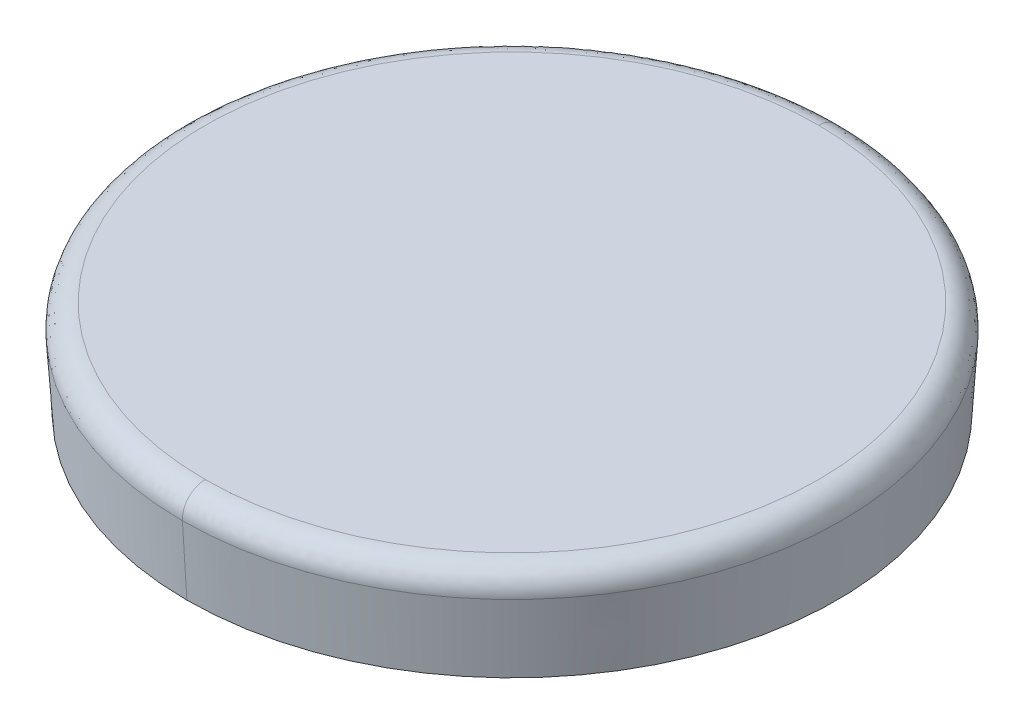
ISO-10303-21;
HEADER;
FILE_DESCRIPTION(('STEP AP214'),'2;1');
FILE_NAME('part.step','',(''),(''),'','','');
FILE_SCHEMA(('AUTOMOTIVE_DESIGN { 1 0 10303 214 1 1 1 1 }'));
ENDSEC;
DATA;
#1=APPLICATION_CONTEXT('core data for automotive mechanical design processes');
#2=APPLICATION_PROTOCOL_DEFINITION('international standard','automotive_design',2000,#1);
#3=PRODUCT_CONTEXT('',#1,'mechanical');
#4=PRODUCT('Part','Part','',(#3));
#5=PRODUCT_RELATED_PRODUCT_CATEGORY('part','',(#4));
#6=PRODUCT_DEFINITION_FORMATION('','',#4);
#7=PRODUCT_DEFINITION_CONTEXT('part definition',#1,'design');
#8=PRODUCT_DEFINITION('design','',#6,#7);
#9=PRODUCT_DEFINITION_SHAPE('','',#8);
#10=(LENGTH_UNIT() NAMED_UNIT(*) SI_UNIT(.MILLI.,.METRE.));
#11=(NAMED_UNIT(*) PLANE_ANGLE_UNIT() SI_UNIT($,.RADIAN.));
#12=(NAMED_UNIT(*) SI_UNIT($,.STERADIAN.) SOLID_ANGLE_UNIT());
#13=UNCERTAINTY_MEASURE_WITH_UNIT(LENGTH_MEASURE(1.E-05),#10,'distance_accuracy_value','');
#14=(GEOMETRIC_REPRESENTATION_CONTEXT(3) GLOBAL_UNCERTAINTY_ASSIGNED_CONTEXT((#13)) GLOBAL_UNIT_ASSIGNED_CONTEXT((#10,
#11,#12)) REPRESENTATION_CONTEXT('',''));
#15=CARTESIAN_POINT('',(0.,0.,0.));
#16=DIRECTION('',(0.,0.,1.));
#17=DIRECTION('',(1.,0.,0.));
#18=AXIS2_PLACEMENT_3D('',#15,#16,#17);
#19=CARTESIAN_POINT('',(21.4,13.2498606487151,-8.7841428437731));
#20=CARTESIAN_POINT('',(29.4317143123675,13.2498606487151,-8.7841428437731));
#21=CARTESIAN_POINT('',(29.4317143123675,13.2498606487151,-16.8158571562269));
#22=CARTESIAN_POINT('',(21.4,13.2498606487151,-16.8158571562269));
#23=CARTESIAN_POINT('',(21.4,13.255742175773,-8.59124459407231));
#24=CARTESIAN_POINT('',(29.8175108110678,13.255742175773,-8.59124459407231));
#25=CARTESIAN_POINT('',(29.8175108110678,13.255742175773,-17.0087554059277));
#26=CARTESIAN_POINT('',(21.4,13.255742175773,-17.0087554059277));
#27=CARTESIAN_POINT('',(21.4,13.1152805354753,-8.45882287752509));
#28=CARTESIAN_POINT('',(30.0823542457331,13.1152805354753,-8.4588228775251));
#29=CARTESIAN_POINT('',(30.0823542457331,13.1152805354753,-17.1411771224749));
#30=CARTESIAN_POINT('',(21.4,13.1152805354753,-17.1411771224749));
#31=CARTESIAN_POINT('',(21.4,12.9229709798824,-8.47622009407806));
#32=CARTESIAN_POINT('',(30.0475598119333,12.9229709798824,-8.47622009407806));
#33=CARTESIAN_POINT('',(30.0475598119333,12.9229709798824,-17.1237799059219));
#34=CARTESIAN_POINT('',(21.4,12.9229709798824,-17.1237799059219));
#35=(BOUNDED_SURFACE() B_SPLINE_SURFACE(3,3,((#19,#20,#21,#22),(#23,#24,#25,#26),(#27,#28,#29,
#30),(#31,#32,#33,#34)),.UNSPECIFIED.,.F.,.F.,.F.) B_SPLINE_SURFACE_WITH_KNOTS((4,4),(4,4),
(0.0430785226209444,0.955176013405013),(0.,1.),
.UNSPECIFIED.) GEOMETRIC_REPRESENTATION_ITEM() RATIONAL_B_SPLINE_SURFACE(((0.96771784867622,
0.322572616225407,0.322572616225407,0.96771784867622),(0.750138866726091,0.250046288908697,
0.250046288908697,0.750138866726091),(0.749723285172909,0.249907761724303,0.249907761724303,
0.749723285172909),(0.966471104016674,0.322157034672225,0.322157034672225,0.966471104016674))) REPRESENTATION_ITEM('') SURFACE());
#36=CARTESIAN_POINT('',(21.4,12.931231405,-12.8));
#37=DIRECTION('',(0.,1.,0.));
#38=DIRECTION('',(0.,0.,1.));
#39=AXIS2_PLACEMENT_3D('',#36,#37,#38);
#40=CIRCLE('',#39,4.32441232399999);
#41=CARTESIAN_POINT('',(21.4,12.9312314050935,-8.47558767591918));
#42=VERTEX_POINT('',#41);
#43=CARTESIAN_POINT('',(21.3999999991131,12.9312314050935,-17.1244123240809));
#44=VERTEX_POINT('',#43);
#45=EDGE_CURVE('E84',#42,#44,#40,.T.);
#46=CARTESIAN_POINT('',(21.3999999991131,12.9312314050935,-17.1244123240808));
#47=CARTESIAN_POINT('',(21.4,13.1154565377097,-17.1359604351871));
#48=CARTESIAN_POINT('',(21.4,13.2500000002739,-17.0095867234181));
#49=CARTESIAN_POINT('',(21.4,13.250000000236,-16.8249999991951));
#50=(BOUNDED_CURVE() B_SPLINE_CURVE(3,(#46,#47,#48,#49),.UNSPECIFIED.,.F.,
.F.) B_SPLINE_CURVE_WITH_KNOTS((4,4),(0.0615373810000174,0.938462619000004),
.UNSPECIFIED.) CURVE() GEOMETRIC_REPRESENTATION_ITEM() RATIONAL_B_SPLINE_CURVE((0.954774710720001,
0.754036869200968,0.754036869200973,0.954774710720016)) REPRESENTATION_ITEM(''));
#51=CARTESIAN_POINT('',(21.4,13.250000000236,-16.8249999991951));
#52=VERTEX_POINT('',#51);
#53=EDGE_CURVE('E53',#44,#52,#50,.T.);
#54=CARTESIAN_POINT('',(21.4,13.250000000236,-8.77500000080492));
#55=CARTESIAN_POINT('',(21.5915795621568,13.25,-8.77500000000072));
#56=CARTESIAN_POINT('',(21.8761392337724,13.25,-8.79512500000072));
#57=CARTESIAN_POINT('',(22.2032085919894,13.25,-8.85382291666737));
#58=CARTESIAN_POINT('',(22.3655140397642,13.25,-8.8919765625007));
#59=CARTESIAN_POINT('',(22.4463594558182,13.25,-8.91325455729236));
#60=CARTESIAN_POINT('',(22.4867053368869,13.25,-8.92444384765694));
#61=CARTESIAN_POINT('',(22.5039799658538,13.25,-8.92935717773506));
#62=CARTESIAN_POINT('',(22.5154927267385,13.25,-8.93265893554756));
#63=CARTESIAN_POINT('',(22.5201588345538,13.25,-8.93400560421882));
#64=CARTESIAN_POINT('',(22.6364586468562,13.25,-8.96791033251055));
#65=CARTESIAN_POINT('',(22.7981481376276,13.25,-9.0225958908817));
#66=CARTESIAN_POINT('',(22.9824135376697,13.25,-9.09833081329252));
#67=CARTESIAN_POINT('',(23.073453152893,13.25,-9.13918205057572));
#68=CARTESIAN_POINT('',(23.1122358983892,13.25,-9.15732910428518));
#69=CARTESIAN_POINT('',(23.1380390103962,13.25,-9.16956922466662));
#70=CARTESIAN_POINT('',(23.1494252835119,13.25,-9.17503454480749));
#71=CARTESIAN_POINT('',(23.2784741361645,13.25,-9.23792588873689));
#72=CARTESIAN_POINT('',(23.4459111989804,13.25,-9.32960064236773));
#73=CARTESIAN_POINT('',(23.6331553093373,13.25,-9.45023887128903));
#74=CARTESIAN_POINT('',(23.7247525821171,13.25,-9.51397907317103));
#75=CARTESIAN_POINT('',(23.7635746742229,13.25,-9.54202939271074));
#76=CARTESIAN_POINT('',(23.7893596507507,13.25,-9.56089251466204));
#77=CARTESIAN_POINT('',(23.8008932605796,13.25,-9.56942279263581));
#78=CARTESIAN_POINT('',(23.9278539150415,13.25,-9.66461765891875));
#79=CARTESIAN_POINT('',(24.0896861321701,13.25,-9.79975898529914));
#80=CARTESIAN_POINT('',(24.2654552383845,13.25,-9.97179983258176));
#81=CARTESIAN_POINT('',(24.350081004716,13.25,-10.0614142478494));
#82=CARTESIAN_POINT('',(24.3856508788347,13.25,-10.1005905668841));
#83=CARTESIAN_POINT('',(24.4092089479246,13.25,-10.1268792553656));
#84=CARTESIAN_POINT('',(24.4199439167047,13.25,-10.1390020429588));
#85=CARTESIAN_POINT('',(24.5332568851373,13.25,-10.2688055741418));
#86=CARTESIAN_POINT('',(24.6736659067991,13.25,-10.4493984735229));
#87=CARTESIAN_POINT('',(24.818795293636,13.25,-10.6732528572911));
#88=CARTESIAN_POINT('',(24.8769905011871,13.25,-10.772011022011));
#89=CARTESIAN_POINT('',(24.9148977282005,13.25,-10.8384765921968));
#90=CARTESIAN_POINT('',(24.9323542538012,13.25,-10.870050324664));
#91=CARTESIAN_POINT('',(25.0279359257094,13.25,-11.0492104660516));
#92=CARTESIAN_POINT('',(25.1289953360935,13.25,-11.2696251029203));
#93=CARTESIAN_POINT('',(25.2230304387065,13.25,-11.5362648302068));
#94=CARTESIAN_POINT('',(25.2582167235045,13.25,-11.6525724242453));
#95=CARTESIAN_POINT('',(25.2805376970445,13.25,-11.7305626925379));
#96=CARTESIAN_POINT('',(25.2908390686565,13.25,-11.7686392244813));
#97=CARTESIAN_POINT('',(25.3836720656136,13.25,-12.133963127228));
#98=CARTESIAN_POINT('',(25.4249542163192,13.25,-12.4649471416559));
#99=CARTESIAN_POINT('',(25.4250228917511,13.25,-12.967526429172));
#100=CARTESIAN_POINT('',(25.4095592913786,13.25,-13.2170174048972));
#101=CARTESIAN_POINT('',(25.3643970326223,13.25,-13.5049425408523));
#102=CARTESIAN_POINT('',(25.3392300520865,13.25,-13.6276645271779));
#103=CARTESIAN_POINT('',(25.3211605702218,13.25,-13.7093292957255));
#104=CARTESIAN_POINT('',(25.3111454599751,13.25,-13.7514050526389));
#105=CARTESIAN_POINT('',(25.2611873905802,13.25,-13.9482259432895));
#106=CARTESIAN_POINT('',(25.187502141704,13.25,-14.1792370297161));
#107=CARTESIAN_POINT('',(25.0774987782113,13.25,-14.4396954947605));
#108=CARTESIAN_POINT('',(25.016487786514,13.25,-14.5676611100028));
#109=CARTESIAN_POINT('',(24.9890525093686,13.25,-14.6220184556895));
#110=CARTESIAN_POINT('',(24.9704761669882,13.25,-14.6581488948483));
#111=CARTESIAN_POINT('',(24.9604777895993,13.25,-14.6772239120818));
#112=CARTESIAN_POINT('',(24.879412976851,13.25,-14.8292675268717));
#113=CARTESIAN_POINT('',(24.7605027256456,13.25,-15.0246871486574));
#114=CARTESIAN_POINT('',(24.6028323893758,13.25,-15.2398926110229));
#115=CARTESIAN_POINT('',(24.5192617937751,13.25,-15.3442993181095));
#116=CARTESIAN_POINT('',(24.482431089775,13.25,-15.3883601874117));
#117=CARTESIAN_POINT('',(24.4576517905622,13.25,-15.4175819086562));
#118=CARTESIAN_POINT('',(24.4441259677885,13.25,-15.4332896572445));
#119=CARTESIAN_POINT('',(24.3398004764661,13.25,-15.5528608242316));
#120=CARTESIAN_POINT('',(24.193058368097,13.25,-15.7042530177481));
#121=CARTESIAN_POINT('',(24.0084866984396,13.25,-15.8668141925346));
#122=CARTESIAN_POINT('',(23.9128577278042,13.25,-15.9445790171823));
#123=CARTESIAN_POINT('',(23.8711574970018,13.25,-15.9771534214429));
#124=CARTESIAN_POINT('',(23.8431981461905,13.25,-15.9987022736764));
#125=CARTESIAN_POINT('',(23.8277594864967,13.25,-16.0104278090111));
#126=CARTESIAN_POINT('',(23.712924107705,13.25,-16.0965775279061));
#127=CARTESIAN_POINT('',(23.5549626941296,13.25,-16.2037578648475));
#128=CARTESIAN_POINT('',(23.3621911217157,13.25,-16.315351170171));
#129=CARTESIAN_POINT('',(23.2636845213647,13.25,-16.3677852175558));
#130=CARTESIAN_POINT('',(23.2210129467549,13.25,-16.3895363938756));
#131=CARTESIAN_POINT('',(23.1924642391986,13.25,-16.4038770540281));
#132=CARTESIAN_POINT('',(23.1765739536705,13.25,-16.4117307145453));
#133=CARTESIAN_POINT('',(23.0612847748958,13.25,-16.4679520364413));
#134=CARTESIAN_POINT('',(22.9048298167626,13.25,-16.5361857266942));
#135=CARTESIAN_POINT('',(22.7175109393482,13.25,-16.604017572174));
#136=CARTESIAN_POINT('',(22.6226544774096,13.25,-16.6349899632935));
#137=CARTESIAN_POINT('',(22.5817452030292,13.25,-16.647633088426));
#138=CARTESIAN_POINT('',(22.554415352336,13.25,-16.655921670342));
#139=CARTESIAN_POINT('',(22.5391300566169,13.25,-16.6604603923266));
#140=CARTESIAN_POINT('',(22.4299595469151,13.25,-16.6923168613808));
#141=CARTESIAN_POINT('',(22.2830907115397,13.25,-16.7292270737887));
#142=CARTESIAN_POINT('',(22.1094544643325,13.25,-16.7625500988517));
#143=CARTESIAN_POINT('',(22.0220640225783,13.25,-16.7767768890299));
#144=CARTESIAN_POINT('',(21.9844883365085,13.25,-16.7823523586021));
#145=CARTESIAN_POINT('',(21.9594106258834,13.25,-16.7859533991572));
#146=CARTESIAN_POINT('',(21.9453629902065,13.25,-16.7878963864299));
#147=CARTESIAN_POINT('',(21.7571567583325,13.25,-16.8131268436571));
#148=CARTESIAN_POINT('',(21.5790594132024,13.25,-16.8249999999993));
#149=CARTESIAN_POINT('',(21.4,13.250000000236,-16.8249999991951));
#150=(BOUNDED_CURVE() B_SPLINE_CURVE(3,(#54,#55,#56,#57,#58,#59,#60,#61,#62,#63,#64,#65,#66,#67,
#68,#69,#70,#71,#72,#73,#74,#75,#76,#77,#78,#79,#80,#81,#82,#83,#84,#85,#86,#87,#88,#89,#90,#91,
#92,#93,#94,#95,#96,#97,#98,#99,#100,#101,#102,#103,#104,#105,#106,#107,#108,#109,#110,#111,
#112,#113,#114,#115,#116,#117,#118,#119,#120,#121,#122,#123,#124,#125,#126,#127,#128,#129,#130,
#131,#132,#133,#134,#135,#136,#137,#138,#139,#140,#141,#142,#143,#144,#145,#146,#147,#148,#149),
.UNSPECIFIED.,.F.,.F.) B_SPLINE_CURVE_WITH_KNOTS((4,1,1,1,1,1,2,2,1,1,1,2,2,1,1,1,2,2,1,1,1,2,2,
1,1,2,2,1,1,2,2,2,1,1,2,2,1,1,1,2,2,1,1,1,2,2,1,1,1,2,2,1,1,1,2,2,1,1,1,2,2,1,1,1,2,2,4),(0.,
0.062499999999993,0.0937499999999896,0.109374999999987,0.117187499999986,0.121093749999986,
0.123046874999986,0.124999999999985,0.156249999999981,0.171874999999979,0.179687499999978,
0.183593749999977,0.187499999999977,0.218749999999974,0.234374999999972,0.242187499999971,
0.246093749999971,0.249999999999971,0.281249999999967,0.296874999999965,0.304687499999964,
0.308593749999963,0.312499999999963,0.343749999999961,0.35937499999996,0.36718749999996,
0.374999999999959,0.406249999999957,0.421874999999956,0.429687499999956,0.437499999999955,0.5,
0.531249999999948,0.546874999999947,0.554687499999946,0.562499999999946,0.593749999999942,
0.609374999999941,0.61718749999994,0.62109374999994,0.62499999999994,0.656249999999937,
0.671874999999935,0.679687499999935,0.683593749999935,0.687499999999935,0.718749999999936,
0.734374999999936,0.742187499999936,0.746093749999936,0.749999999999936,0.781249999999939,
0.796874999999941,0.804687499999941,0.808593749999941,0.812499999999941,0.843749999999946,
0.859374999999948,0.867187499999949,0.87109374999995,0.874999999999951,0.906249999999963,
0.921874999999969,0.929687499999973,0.933593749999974,0.937499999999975,1.),
.UNSPECIFIED.) CURVE() GEOMETRIC_REPRESENTATION_ITEM() RATIONAL_B_SPLINE_CURVE((1.,1.,1.,1.,1.,
1.,1.,1.,1.,1.,1.,1.,1.,1.,1.,1.,1.,1.,1.,1.,1.,1.,1.,1.,1.,1.,1.,1.,1.,1.,1.,1.,1.,1.,1.,1.,1.,
1.,1.,1.,1.,1.,1.,1.,1.,1.,1.,1.,1.,1.,1.,1.,1.,1.,1.,1.,1.,1.,1.,1.,1.,1.,1.,1.,1.,1.,1.,1.,1.,
1.,1.,1.,1.,1.,1.,1.,1.,1.,1.,1.,1.,1.,1.,1.,1.,1.,1.,1.,1.,1.,1.,1.,1.,1.,1.,1.)) REPRESENTATION_ITEM(''));
#151=CARTESIAN_POINT('',(21.4,13.250000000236,-8.77500000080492));
#152=VERTEX_POINT('',#151);
#153=EDGE_CURVE('E11',#152,#52,#150,.T.);
#154=CARTESIAN_POINT('',(21.4,13.250000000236,-8.77500000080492));
#155=CARTESIAN_POINT('',(21.4,13.2500000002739,-8.5904132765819));
#156=CARTESIAN_POINT('',(21.4,13.1154565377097,-8.46403956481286));
#157=CARTESIAN_POINT('',(21.4,12.9312314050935,-8.47558767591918));
#158=(BOUNDED_CURVE() B_SPLINE_CURVE(3,(#154,#155,#156,#157),.UNSPECIFIED.,.F.,
.F.) B_SPLINE_CURVE_WITH_KNOTS((4,4),(0.0615373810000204,0.938462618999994),
.UNSPECIFIED.) CURVE() GEOMETRIC_REPRESENTATION_ITEM() RATIONAL_B_SPLINE_CURVE((0.954774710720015,
0.754036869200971,0.754036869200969,0.954774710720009)) REPRESENTATION_ITEM(''));
#159=EDGE_CURVE('E97',#152,#42,#158,.T.);
#160=ORIENTED_EDGE('',*,*,#45,.T.);
#161=ORIENTED_EDGE('',*,*,#53,.T.);
#162=ORIENTED_EDGE('',*,*,#153,.F.);
#163=ORIENTED_EDGE('',*,*,#159,.T.);
#164=EDGE_LOOP('',(#160,#161,#162,#163));
#165=FACE_BOUND('',#164,.T.);
#166=ADVANCED_FACE('F16',(#165),#35,.T.);
#167=CARTESIAN_POINT('',(17.3267,13.25,-16.8733));
#168=DIRECTION('',(0.,1.,0.));
#169=DIRECTION('',(1.,0.,0.));
#170=AXIS2_PLACEMENT_3D('',#167,#168,#169);
#171=PLANE('',#170);
#172=ORIENTED_EDGE('',*,*,#153,.T.);
#173=CARTESIAN_POINT('',(21.4,13.250000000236,-8.77500000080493));
#174=CARTESIAN_POINT('',(13.350000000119,13.2500000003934,-8.77500000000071));
#175=CARTESIAN_POINT('',(13.350000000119,13.2500000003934,-16.8249999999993));
#176=CARTESIAN_POINT('',(21.4,13.250000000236,-16.8249999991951));
#177=(BOUNDED_CURVE() B_SPLINE_CURVE(3,(#173,#174,#175,#176),.UNSPECIFIED.,.F.,
.F.) B_SPLINE_CURVE_WITH_KNOTS((4,4),(0.,1.),
.UNSPECIFIED.) CURVE() GEOMETRIC_REPRESENTATION_ITEM() RATIONAL_B_SPLINE_CURVE((0.954774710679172,
0.318258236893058,0.318258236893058,0.954774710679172)) REPRESENTATION_ITEM(''));
#178=EDGE_CURVE('E29',#152,#52,#177,.T.);
#179=ORIENTED_EDGE('',*,*,#178,.F.);
#180=EDGE_LOOP('',(#172,#179));
#181=FACE_BOUND('',#180,.T.);
#182=ADVANCED_FACE('F122',(#181),#171,.T.);
#183=CARTESIAN_POINT('',(17.082769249,12.,-8.482769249));
#184=DIRECTION('',(0.,-1.,0.));
#185=DIRECTION('',(0.,0.,-1.));
#186=AXIS2_PLACEMENT_3D('',#183,#184,#185);
#187=PLANE('',#186);
#188=CARTESIAN_POINT('',(21.4,12.,-12.8));
#189=DIRECTION('',(0.,-1.,0.));
#190=DIRECTION('',(0.,0.,1.));
#191=AXIS2_PLACEMENT_3D('',#188,#189,#190);
#192=CIRCLE('',#191,4.26603829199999);
#193=CARTESIAN_POINT('',(21.4,12.,-8.53396170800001));
#194=VERTEX_POINT('',#193);
#195=CARTESIAN_POINT('',(21.4,12.,-17.066038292));
#196=VERTEX_POINT('',#195);
#197=EDGE_CURVE('E62',#194,#196,#192,.T.);
#198=ORIENTED_EDGE('',*,*,#197,.T.);
#199=CARTESIAN_POINT('',(21.4,12.,-12.8));
#200=DIRECTION('',(0.,-1.,0.));
#201=DIRECTION('',(0.,0.,1.));
#202=AXIS2_PLACEMENT_3D('',#199,#200,#201);
#203=CIRCLE('',#202,4.26603829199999);
#204=EDGE_CURVE('E72',#196,#194,#203,.T.);
#205=ORIENTED_EDGE('',*,*,#204,.T.);
#206=EDGE_LOOP('',(#198,#205));
#207=FACE_BOUND('',#206,.T.);
#208=ADVANCED_FACE('F70',(#207),#187,.T.);
#209=CARTESIAN_POINT('',(21.4,13.2499988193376,-16.8241581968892));
#210=CARTESIAN_POINT('',(13.3516836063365,13.2499988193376,-16.8241581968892));
#211=CARTESIAN_POINT('',(13.3516836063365,13.2499988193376,-8.77584180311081));
#212=CARTESIAN_POINT('',(21.4,13.2499988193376,-8.77584180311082));
#213=CARTESIAN_POINT('',(21.4,13.2505303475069,-17.0135823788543));
#214=CARTESIAN_POINT('',(12.9728352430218,13.2505303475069,-17.0135823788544));
#215=CARTESIAN_POINT('',(12.9728352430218,13.2505303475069,-8.58641762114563));
#216=CARTESIAN_POINT('',(21.4,13.2505303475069,-8.58641762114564));
#217=CARTESIAN_POINT('',(21.4,13.1107466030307,-17.1407669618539));
#218=CARTESIAN_POINT('',(12.7184660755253,13.1107466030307,-17.1407669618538));
#219=CARTESIAN_POINT('',(12.7184660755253,13.1107466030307,-8.45923303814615));
#220=CARTESIAN_POINT('',(21.4,13.1107466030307,-8.45923303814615));
#221=CARTESIAN_POINT('',(21.4,12.9229709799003,-17.1237799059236));
#222=CARTESIAN_POINT('',(12.7524401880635,12.9229709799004,-17.1237799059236));
#223=CARTESIAN_POINT('',(12.7524401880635,12.9229709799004,-8.47622009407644));
#224=CARTESIAN_POINT('',(21.4,12.9229709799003,-8.47622009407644));
#225=(BOUNDED_SURFACE() B_SPLINE_SURFACE(3,3,((#209,#210,#211,#212),(#213,#214,#215,#216),(#217,
#218,#219,#220),(#221,#222,#223,#224)),.UNSPECIFIED.,.F.,.F.,
.F.) B_SPLINE_SURFACE_WITH_KNOTS((4,4),(4,4),(0.0598484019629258,0.955176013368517),(0.,1.),
.UNSPECIFIED.) GEOMETRIC_REPRESENTATION_ITEM() RATIONAL_B_SPLINE_SURFACE(((0.955936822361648,
0.318645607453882,0.318645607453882,0.955936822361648),(0.750196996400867,0.250065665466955,
0.250065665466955,0.750196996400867),(0.753708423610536,0.251236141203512,0.251236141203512,
0.753708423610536),(0.966471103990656,0.322157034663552,0.322157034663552,0.966471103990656))) REPRESENTATION_ITEM('') SURFACE());
#226=CARTESIAN_POINT('',(21.4,12.931231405,-12.8));
#227=DIRECTION('',(0.,1.,0.));
#228=DIRECTION('',(0.,0.,1.));
#229=AXIS2_PLACEMENT_3D('',#226,#227,#228);
#230=CIRCLE('',#229,4.32441232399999);
#231=EDGE_CURVE('E74',#44,#42,#230,.T.);
#232=ORIENTED_EDGE('',*,*,#53,.F.);
#233=ORIENTED_EDGE('',*,*,#231,.T.);
#234=ORIENTED_EDGE('',*,*,#159,.F.);
#235=ORIENTED_EDGE('',*,*,#178,.T.);
#236=EDGE_LOOP('',(#232,#233,#234,#235));
#237=FACE_BOUND('',#236,.T.);
#238=ADVANCED_FACE('F119',(#237),#225,.T.);
#239=CARTESIAN_POINT('',(21.4,12.,-12.8));
#240=DIRECTION('',(0.,1.,0.));
#241=DIRECTION('',(0.,0.,1.));
#242=AXIS2_PLACEMENT_3D('',#239,#240,#241);
#243=CONICAL_SURFACE('',#242,4.266038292,0.0626028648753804);
#244=DIRECTION('',(0.,0.998041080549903,-0.062561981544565));
#245=VECTOR('',#244,1.);
#246=CARTESIAN_POINT('',(21.4,12.,-17.066038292));
#247=LINE('',#246,#245);
#248=EDGE_CURVE('E78',#196,#44,#247,.T.);
#249=ORIENTED_EDGE('',*,*,#248,.F.);
#250=ORIENTED_EDGE('',*,*,#197,.F.);
#251=DIRECTION('',(0.,0.998041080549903,0.062561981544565));
#252=VECTOR('',#251,1.);
#253=CARTESIAN_POINT('',(21.4,12.,-8.533961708));
#254=LINE('',#253,#252);
#255=EDGE_CURVE('E75',#194,#42,#254,.T.);
#256=ORIENTED_EDGE('',*,*,#255,.T.);
#257=ORIENTED_EDGE('',*,*,#231,.F.);
#258=EDGE_LOOP('',(#249,#250,#256,#257));
#259=FACE_BOUND('',#258,.T.);
#260=ADVANCED_FACE('F79',(#259),#243,.T.);
#261=CARTESIAN_POINT('',(21.4,12.,-12.8));
#262=DIRECTION('',(0.,1.,0.));
#263=DIRECTION('',(0.,0.,1.));
#264=AXIS2_PLACEMENT_3D('',#261,#262,#263);
#265=CONICAL_SURFACE('',#264,4.266038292,0.0626028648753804);
#266=ORIENTED_EDGE('',*,*,#204,.F.);
#267=ORIENTED_EDGE('',*,*,#248,.T.);
#268=ORIENTED_EDGE('',*,*,#45,.F.);
#269=ORIENTED_EDGE('',*,*,#255,.F.);
#270=EDGE_LOOP('',(#266,#267,#268,#269));
#271=FACE_BOUND('',#270,.T.);
#272=ADVANCED_FACE('F86',(#271),#265,.T.);
#273=CLOSED_SHELL('',(#166,#182,#208,#238,#260,#272));
#274=MANIFOLD_SOLID_BREP('B1',#273);
#275=ADVANCED_BREP_SHAPE_REPRESENTATION('',(#18,#274),#14);
#276=SHAPE_DEFINITION_REPRESENTATION(#9,#275);
ENDSEC;
END-ISO-10303-21;
